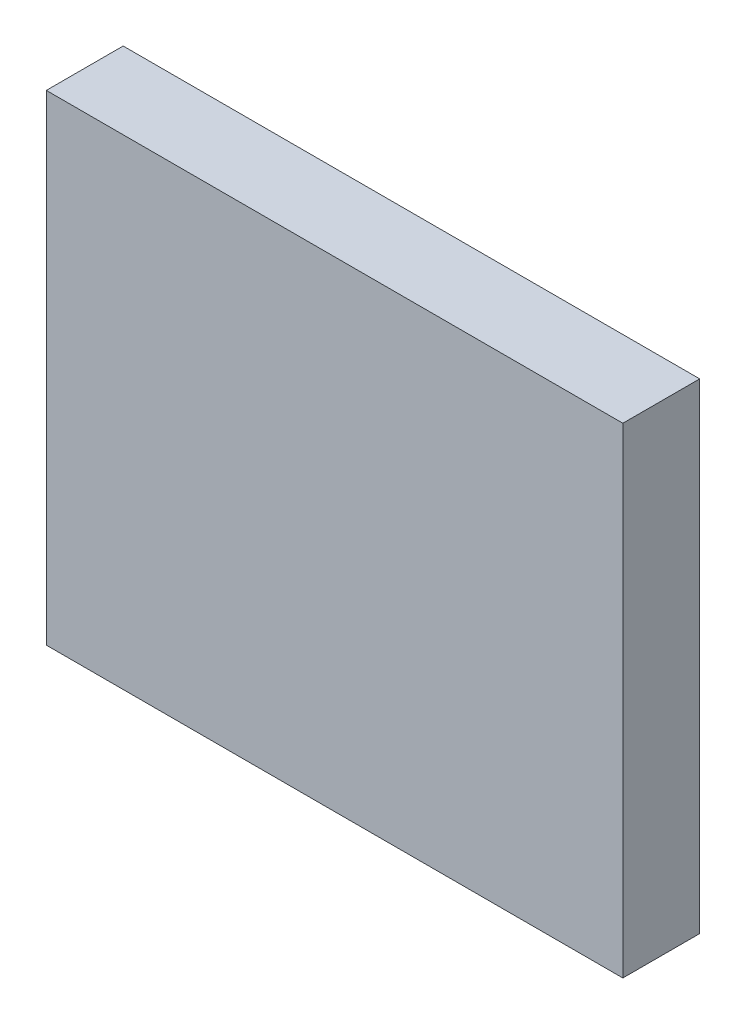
ISO-10303-21;
HEADER;
FILE_DESCRIPTION(('STEP AP214'),'2;1');
FILE_NAME('part.step','',(''),(''),'','','');
FILE_SCHEMA(('AUTOMOTIVE_DESIGN { 1 0 10303 214 1 1 1 1 }'));
ENDSEC;
DATA;
#1=APPLICATION_CONTEXT('core data for automotive mechanical design processes');
#2=APPLICATION_PROTOCOL_DEFINITION('international standard','automotive_design',2000,#1);
#3=PRODUCT_CONTEXT('',#1,'mechanical');
#4=PRODUCT('Part','Part','',(#3));
#5=PRODUCT_RELATED_PRODUCT_CATEGORY('part','',(#4));
#6=PRODUCT_DEFINITION_FORMATION('','',#4);
#7=PRODUCT_DEFINITION_CONTEXT('part definition',#1,'design');
#8=PRODUCT_DEFINITION('design','',#6,#7);
#9=PRODUCT_DEFINITION_SHAPE('','',#8);
#10=(LENGTH_UNIT() NAMED_UNIT(*) SI_UNIT(.MILLI.,.METRE.));
#11=(NAMED_UNIT(*) PLANE_ANGLE_UNIT() SI_UNIT($,.RADIAN.));
#12=(NAMED_UNIT(*) SI_UNIT($,.STERADIAN.) SOLID_ANGLE_UNIT());
#13=UNCERTAINTY_MEASURE_WITH_UNIT(LENGTH_MEASURE(1.E-05),#10,'distance_accuracy_value','');
#14=(GEOMETRIC_REPRESENTATION_CONTEXT(3) GLOBAL_UNCERTAINTY_ASSIGNED_CONTEXT((#13)) GLOBAL_UNIT_ASSIGNED_CONTEXT((#10,
#11,#12)) REPRESENTATION_CONTEXT('',''));
#15=CARTESIAN_POINT('',(0.,0.,0.));
#16=DIRECTION('',(0.,0.,1.));
#17=DIRECTION('',(1.,0.,0.));
#18=AXIS2_PLACEMENT_3D('',#15,#16,#17);
#19=CARTESIAN_POINT('',(0.,0.,8.));
#20=DIRECTION('',(1.,0.,0.));
#21=DIRECTION('',(0.,0.,-1.));
#22=AXIS2_PLACEMENT_3D('',#19,#20,#21);
#23=PLANE('',#22);
#24=DIRECTION('',(0.,-1.,0.));
#25=VECTOR('',#24,1.);
#26=CARTESIAN_POINT('',(0.,0.,0.));
#27=LINE('',#26,#25);
#28=CARTESIAN_POINT('',(0.,50.,0.));
#29=VERTEX_POINT('',#28);
#30=CARTESIAN_POINT('',(0.,0.,0.));
#31=VERTEX_POINT('',#30);
#32=EDGE_CURVE('E102',#29,#31,#27,.T.);
#33=ORIENTED_EDGE('',*,*,#32,.T.);
#34=DIRECTION('',(0.,0.,-1.));
#35=VECTOR('',#34,1.);
#36=CARTESIAN_POINT('',(0.,0.,8.));
#37=LINE('',#36,#35);
#38=CARTESIAN_POINT('',(0.,0.,8.));
#39=VERTEX_POINT('',#38);
#40=EDGE_CURVE('E11',#39,#31,#37,.T.);
#41=ORIENTED_EDGE('',*,*,#40,.F.);
#42=DIRECTION('',(0.,-1.,0.));
#43=VECTOR('',#42,1.);
#44=CARTESIAN_POINT('',(0.,0.,8.));
#45=LINE('',#44,#43);
#46=CARTESIAN_POINT('',(0.,50.,8.));
#47=VERTEX_POINT('',#46);
#48=EDGE_CURVE('E90',#47,#39,#45,.T.);
#49=ORIENTED_EDGE('',*,*,#48,.F.);
#50=DIRECTION('',(0.,0.,-1.));
#51=VECTOR('',#50,1.);
#52=CARTESIAN_POINT('',(0.,50.,8.));
#53=LINE('',#52,#51);
#54=EDGE_CURVE('E98',#47,#29,#53,.T.);
#55=ORIENTED_EDGE('',*,*,#54,.T.);
#56=EDGE_LOOP('',(#33,#41,#49,#55));
#57=FACE_BOUND('',#56,.T.);
#58=ADVANCED_FACE('F39',(#57),#23,.F.);
#59=CARTESIAN_POINT('',(0.,0.,8.));
#60=DIRECTION('',(0.,1.,0.));
#61=DIRECTION('',(0.,0.,1.));
#62=AXIS2_PLACEMENT_3D('',#59,#60,#61);
#63=PLANE('',#62);
#64=DIRECTION('',(1.,0.,0.));
#65=VECTOR('',#64,1.);
#66=CARTESIAN_POINT('',(0.,0.,0.));
#67=LINE('',#66,#65);
#68=CARTESIAN_POINT('',(60.,0.,0.));
#69=VERTEX_POINT('',#68);
#70=EDGE_CURVE('E94',#31,#69,#67,.T.);
#71=ORIENTED_EDGE('',*,*,#70,.T.);
#72=DIRECTION('',(0.,0.,-1.));
#73=VECTOR('',#72,1.);
#74=CARTESIAN_POINT('',(60.,0.,8.));
#75=LINE('',#74,#73);
#76=CARTESIAN_POINT('',(60.,0.,8.));
#77=VERTEX_POINT('',#76);
#78=EDGE_CURVE('E47',#77,#69,#75,.T.);
#79=ORIENTED_EDGE('',*,*,#78,.F.);
#80=DIRECTION('',(1.,0.,0.));
#81=VECTOR('',#80,1.);
#82=CARTESIAN_POINT('',(0.,0.,8.));
#83=LINE('',#82,#81);
#84=EDGE_CURVE('E85',#39,#77,#83,.T.);
#85=ORIENTED_EDGE('',*,*,#84,.F.);
#86=ORIENTED_EDGE('',*,*,#40,.T.);
#87=EDGE_LOOP('',(#71,#79,#85,#86));
#88=FACE_BOUND('',#87,.T.);
#89=ADVANCED_FACE('F93',(#88),#63,.F.);
#90=CARTESIAN_POINT('',(60.,0.,8.));
#91=DIRECTION('',(-1.,0.,0.));
#92=DIRECTION('',(0.,0.,1.));
#93=AXIS2_PLACEMENT_3D('',#90,#91,#92);
#94=PLANE('',#93);
#95=DIRECTION('',(0.,1.,0.));
#96=VECTOR('',#95,1.);
#97=CARTESIAN_POINT('',(60.,0.,0.));
#98=LINE('',#97,#96);
#99=CARTESIAN_POINT('',(60.,50.,0.));
#100=VERTEX_POINT('',#99);
#101=EDGE_CURVE('E72',#69,#100,#98,.T.);
#102=ORIENTED_EDGE('',*,*,#101,.T.);
#103=DIRECTION('',(0.,0.,-1.));
#104=VECTOR('',#103,1.);
#105=CARTESIAN_POINT('',(60.,50.,8.));
#106=LINE('',#105,#104);
#107=CARTESIAN_POINT('',(60.,50.,8.));
#108=VERTEX_POINT('',#107);
#109=EDGE_CURVE('E95',#108,#100,#106,.T.);
#110=ORIENTED_EDGE('',*,*,#109,.F.);
#111=DIRECTION('',(0.,1.,0.));
#112=VECTOR('',#111,1.);
#113=CARTESIAN_POINT('',(60.,0.,8.));
#114=LINE('',#113,#112);
#115=EDGE_CURVE('E88',#77,#108,#114,.T.);
#116=ORIENTED_EDGE('',*,*,#115,.F.);
#117=ORIENTED_EDGE('',*,*,#78,.T.);
#118=EDGE_LOOP('',(#102,#110,#116,#117));
#119=FACE_BOUND('',#118,.T.);
#120=ADVANCED_FACE('F96',(#119),#94,.F.);
#121=CARTESIAN_POINT('',(0.,50.,8.));
#122=DIRECTION('',(0.,-1.,0.));
#123=DIRECTION('',(0.,0.,-1.));
#124=AXIS2_PLACEMENT_3D('',#121,#122,#123);
#125=PLANE('',#124);
#126=DIRECTION('',(-1.,0.,0.));
#127=VECTOR('',#126,1.);
#128=CARTESIAN_POINT('',(0.,50.,0.));
#129=LINE('',#128,#127);
#130=EDGE_CURVE('E78',#100,#29,#129,.T.);
#131=ORIENTED_EDGE('',*,*,#130,.T.);
#132=ORIENTED_EDGE('',*,*,#54,.F.);
#133=DIRECTION('',(-1.,0.,0.));
#134=VECTOR('',#133,1.);
#135=CARTESIAN_POINT('',(0.,50.,8.));
#136=LINE('',#135,#134);
#137=EDGE_CURVE('E55',#108,#47,#136,.T.);
#138=ORIENTED_EDGE('',*,*,#137,.F.);
#139=ORIENTED_EDGE('',*,*,#109,.T.);
#140=EDGE_LOOP('',(#131,#132,#138,#139));
#141=FACE_BOUND('',#140,.T.);
#142=ADVANCED_FACE('F109',(#141),#125,.F.);
#143=CARTESIAN_POINT('',(0.,50.,8.));
#144=DIRECTION('',(0.,0.,-1.));
#145=DIRECTION('',(-1.,0.,0.));
#146=AXIS2_PLACEMENT_3D('',#143,#144,#145);
#147=PLANE('',#146);
#148=ORIENTED_EDGE('',*,*,#48,.T.);
#149=ORIENTED_EDGE('',*,*,#84,.T.);
#150=ORIENTED_EDGE('',*,*,#115,.T.);
#151=ORIENTED_EDGE('',*,*,#137,.T.);
#152=EDGE_LOOP('',(#148,#149,#150,#151));
#153=FACE_BOUND('',#152,.T.);
#154=ADVANCED_FACE('F86',(#153),#147,.F.);
#155=CARTESIAN_POINT('',(0.,50.,0.));
#156=DIRECTION('',(0.,0.,-1.));
#157=DIRECTION('',(-1.,0.,0.));
#158=AXIS2_PLACEMENT_3D('',#155,#156,#157);
#159=PLANE('',#158);
#160=ORIENTED_EDGE('',*,*,#32,.F.);
#161=ORIENTED_EDGE('',*,*,#130,.F.);
#162=ORIENTED_EDGE('',*,*,#101,.F.);
#163=ORIENTED_EDGE('',*,*,#70,.F.);
#164=EDGE_LOOP('',(#160,#161,#162,#163));
#165=FACE_BOUND('',#164,.T.);
#166=ADVANCED_FACE('F112',(#165),#159,.T.);
#167=CLOSED_SHELL('',(#58,#89,#120,#142,#154,#166));
#168=MANIFOLD_SOLID_BREP('B2',#167);
#169=ADVANCED_BREP_SHAPE_REPRESENTATION('',(#18,#168),#14);
#170=SHAPE_DEFINITION_REPRESENTATION(#9,#169);
ENDSEC;
END-ISO-10303-21;
